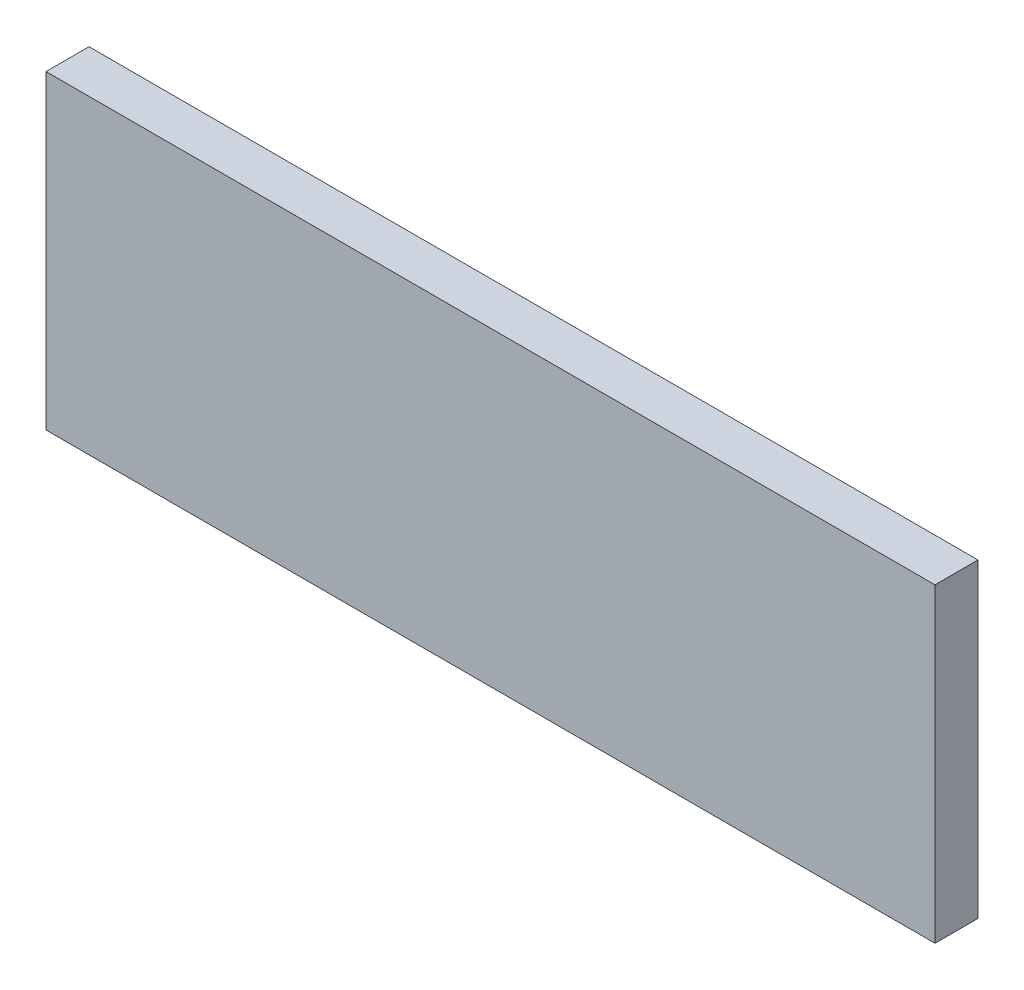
ISO-10303-21;
HEADER;
FILE_DESCRIPTION(('STEP AP214'),'2;1');
FILE_NAME('part.step','',(''),(''),'','','');
FILE_SCHEMA(('AUTOMOTIVE_DESIGN { 1 0 10303 214 1 1 1 1 }'));
ENDSEC;
DATA;
#1=APPLICATION_CONTEXT('core data for automotive mechanical design processes');
#2=APPLICATION_PROTOCOL_DEFINITION('international standard','automotive_design',2000,#1);
#3=PRODUCT_CONTEXT('',#1,'mechanical');
#4=PRODUCT('Part','Part','',(#3));
#5=PRODUCT_RELATED_PRODUCT_CATEGORY('part','',(#4));
#6=PRODUCT_DEFINITION_FORMATION('','',#4);
#7=PRODUCT_DEFINITION_CONTEXT('part definition',#1,'design');
#8=PRODUCT_DEFINITION('design','',#6,#7);
#9=PRODUCT_DEFINITION_SHAPE('','',#8);
#10=(LENGTH_UNIT() NAMED_UNIT(*) SI_UNIT(.MILLI.,.METRE.));
#11=(NAMED_UNIT(*) PLANE_ANGLE_UNIT() SI_UNIT($,.RADIAN.));
#12=(NAMED_UNIT(*) SI_UNIT($,.STERADIAN.) SOLID_ANGLE_UNIT());
#13=UNCERTAINTY_MEASURE_WITH_UNIT(LENGTH_MEASURE(1.E-05),#10,'distance_accuracy_value','');
#14=(GEOMETRIC_REPRESENTATION_CONTEXT(3) GLOBAL_UNCERTAINTY_ASSIGNED_CONTEXT((#13)) GLOBAL_UNIT_ASSIGNED_CONTEXT((#10,
#11,#12)) REPRESENTATION_CONTEXT('',''));
#15=CARTESIAN_POINT('',(0.,0.,0.));
#16=DIRECTION('',(0.,0.,1.));
#17=DIRECTION('',(1.,0.,0.));
#18=AXIS2_PLACEMENT_3D('',#15,#16,#17);
#19=CARTESIAN_POINT('',(2.06,11.11,-0.73152));
#20=DIRECTION('',(0.,-1.,0.));
#21=DIRECTION('',(0.,0.,-1.));
#22=AXIS2_PLACEMENT_3D('',#19,#20,#21);
#23=PLANE('',#22);
#24=DIRECTION('',(1.,0.,0.));
#25=VECTOR('',#24,1.);
#26=CARTESIAN_POINT('',(2.375,11.11,-0.70104));
#27=LINE('',#26,#25);
#28=CARTESIAN_POINT('',(2.06,11.11,-0.70104));
#29=VERTEX_POINT('',#28);
#30=CARTESIAN_POINT('',(2.69,11.11,-0.70104));
#31=VERTEX_POINT('',#30);
#32=EDGE_CURVE('E67',#29,#31,#27,.T.);
#33=ORIENTED_EDGE('',*,*,#32,.T.);
#34=DIRECTION('',(0.,0.,-1.));
#35=VECTOR('',#34,1.);
#36=CARTESIAN_POINT('',(2.69,11.11,-0.71628));
#37=LINE('',#36,#35);
#38=CARTESIAN_POINT('',(2.69,11.11,-0.73152));
#39=VERTEX_POINT('',#38);
#40=EDGE_CURVE('E61',#31,#39,#37,.T.);
#41=ORIENTED_EDGE('',*,*,#40,.T.);
#42=DIRECTION('',(1.,0.,0.));
#43=VECTOR('',#42,1.);
#44=CARTESIAN_POINT('',(2.06,11.11,-0.73152));
#45=LINE('',#44,#43);
#46=CARTESIAN_POINT('',(2.06,11.11,-0.73152));
#47=VERTEX_POINT('',#46);
#48=EDGE_CURVE('E65',#47,#39,#45,.T.);
#49=ORIENTED_EDGE('',*,*,#48,.F.);
#50=DIRECTION('',(0.,0.,-1.));
#51=VECTOR('',#50,1.);
#52=CARTESIAN_POINT('',(2.06,11.11,-0.71628));
#53=LINE('',#52,#51);
#54=EDGE_CURVE('E11',#29,#47,#53,.T.);
#55=ORIENTED_EDGE('',*,*,#54,.F.);
#56=EDGE_LOOP('',(#33,#41,#49,#55));
#57=FACE_BOUND('',#56,.T.);
#58=ADVANCED_FACE('F17',(#57),#23,.F.);
#59=CARTESIAN_POINT('',(2.06,10.89,-0.73152));
#60=DIRECTION('',(1.,0.,0.));
#61=DIRECTION('',(0.,1.,0.));
#62=AXIS2_PLACEMENT_3D('',#59,#60,#61);
#63=PLANE('',#62);
#64=DIRECTION('',(0.,1.,0.));
#65=VECTOR('',#64,1.);
#66=CARTESIAN_POINT('',(2.06,11.,-0.70104));
#67=LINE('',#66,#65);
#68=CARTESIAN_POINT('',(2.06,10.89,-0.70104));
#69=VERTEX_POINT('',#68);
#70=EDGE_CURVE('E102',#69,#29,#67,.T.);
#71=ORIENTED_EDGE('',*,*,#70,.T.);
#72=ORIENTED_EDGE('',*,*,#54,.T.);
#73=DIRECTION('',(0.,1.,0.));
#74=VECTOR('',#73,1.);
#75=CARTESIAN_POINT('',(2.06,10.89,-0.73152));
#76=LINE('',#75,#74);
#77=CARTESIAN_POINT('',(2.06,10.89,-0.73152));
#78=VERTEX_POINT('',#77);
#79=EDGE_CURVE('E84',#78,#47,#76,.T.);
#80=ORIENTED_EDGE('',*,*,#79,.F.);
#81=DIRECTION('',(0.,0.,-1.));
#82=VECTOR('',#81,1.);
#83=CARTESIAN_POINT('',(2.06,10.89,-0.71628));
#84=LINE('',#83,#82);
#85=EDGE_CURVE('E26',#69,#78,#84,.T.);
#86=ORIENTED_EDGE('',*,*,#85,.F.);
#87=EDGE_LOOP('',(#71,#72,#80,#86));
#88=FACE_BOUND('',#87,.T.);
#89=ADVANCED_FACE('F119',(#88),#63,.F.);
#90=CARTESIAN_POINT('',(2.69,10.89,-0.73152));
#91=DIRECTION('',(0.,1.,0.));
#92=DIRECTION('',(1.,0.,0.));
#93=AXIS2_PLACEMENT_3D('',#90,#91,#92);
#94=PLANE('',#93);
#95=DIRECTION('',(-1.,0.,0.));
#96=VECTOR('',#95,1.);
#97=CARTESIAN_POINT('',(2.375,10.89,-0.70104));
#98=LINE('',#97,#96);
#99=CARTESIAN_POINT('',(2.69,10.89,-0.70104));
#100=VERTEX_POINT('',#99);
#101=EDGE_CURVE('E90',#100,#69,#98,.T.);
#102=ORIENTED_EDGE('',*,*,#101,.T.);
#103=ORIENTED_EDGE('',*,*,#85,.T.);
#104=DIRECTION('',(-1.,0.,0.));
#105=VECTOR('',#104,1.);
#106=CARTESIAN_POINT('',(2.69,10.89,-0.73152));
#107=LINE('',#106,#105);
#108=CARTESIAN_POINT('',(2.69,10.89,-0.73152));
#109=VERTEX_POINT('',#108);
#110=EDGE_CURVE('E80',#109,#78,#107,.T.);
#111=ORIENTED_EDGE('',*,*,#110,.F.);
#112=DIRECTION('',(0.,0.,-1.));
#113=VECTOR('',#112,1.);
#114=CARTESIAN_POINT('',(2.69,10.89,-0.71628));
#115=LINE('',#114,#113);
#116=EDGE_CURVE('E72',#100,#109,#115,.T.);
#117=ORIENTED_EDGE('',*,*,#116,.F.);
#118=EDGE_LOOP('',(#102,#103,#111,#117));
#119=FACE_BOUND('',#118,.T.);
#120=ADVANCED_FACE('F138',(#119),#94,.F.);
#121=CARTESIAN_POINT('',(2.69,11.11,-0.73152));
#122=DIRECTION('',(-1.,0.,0.));
#123=DIRECTION('',(0.,0.,1.));
#124=AXIS2_PLACEMENT_3D('',#121,#122,#123);
#125=PLANE('',#124);
#126=DIRECTION('',(0.,-1.,0.));
#127=VECTOR('',#126,1.);
#128=CARTESIAN_POINT('',(2.69,11.,-0.70104));
#129=LINE('',#128,#127);
#130=EDGE_CURVE('E86',#31,#100,#129,.T.);
#131=ORIENTED_EDGE('',*,*,#130,.T.);
#132=ORIENTED_EDGE('',*,*,#116,.T.);
#133=DIRECTION('',(0.,-1.,0.));
#134=VECTOR('',#133,1.);
#135=CARTESIAN_POINT('',(2.69,11.11,-0.73152));
#136=LINE('',#135,#134);
#137=EDGE_CURVE('E75',#39,#109,#136,.T.);
#138=ORIENTED_EDGE('',*,*,#137,.F.);
#139=ORIENTED_EDGE('',*,*,#40,.F.);
#140=EDGE_LOOP('',(#131,#132,#138,#139));
#141=FACE_BOUND('',#140,.T.);
#142=ADVANCED_FACE('F76',(#141),#125,.F.);
#143=CARTESIAN_POINT('',(2.375,11.,-0.73152));
#144=DIRECTION('',(0.,0.,1.));
#145=DIRECTION('',(1.,0.,0.));
#146=AXIS2_PLACEMENT_3D('',#143,#144,#145);
#147=PLANE('',#146);
#148=ORIENTED_EDGE('',*,*,#48,.T.);
#149=ORIENTED_EDGE('',*,*,#137,.T.);
#150=ORIENTED_EDGE('',*,*,#110,.T.);
#151=ORIENTED_EDGE('',*,*,#79,.T.);
#152=EDGE_LOOP('',(#148,#149,#150,#151));
#153=FACE_BOUND('',#152,.T.);
#154=ADVANCED_FACE('F83',(#153),#147,.F.);
#155=CARTESIAN_POINT('',(2.375,11.,-0.70104));
#156=DIRECTION('',(0.,0.,1.));
#157=DIRECTION('',(1.,0.,0.));
#158=AXIS2_PLACEMENT_3D('',#155,#156,#157);
#159=PLANE('',#158);
#160=ORIENTED_EDGE('',*,*,#32,.F.);
#161=ORIENTED_EDGE('',*,*,#70,.F.);
#162=ORIENTED_EDGE('',*,*,#101,.F.);
#163=ORIENTED_EDGE('',*,*,#130,.F.);
#164=EDGE_LOOP('',(#160,#161,#162,#163));
#165=FACE_BOUND('',#164,.T.);
#166=ADVANCED_FACE('F123',(#165),#159,.T.);
#167=CLOSED_SHELL('',(#58,#89,#120,#142,#154,#166));
#168=MANIFOLD_SOLID_BREP('B1',#167);
#169=ADVANCED_BREP_SHAPE_REPRESENTATION('',(#18,#168),#14);
#170=SHAPE_DEFINITION_REPRESENTATION(#9,#169);
ENDSEC;
END-ISO-10303-21;
